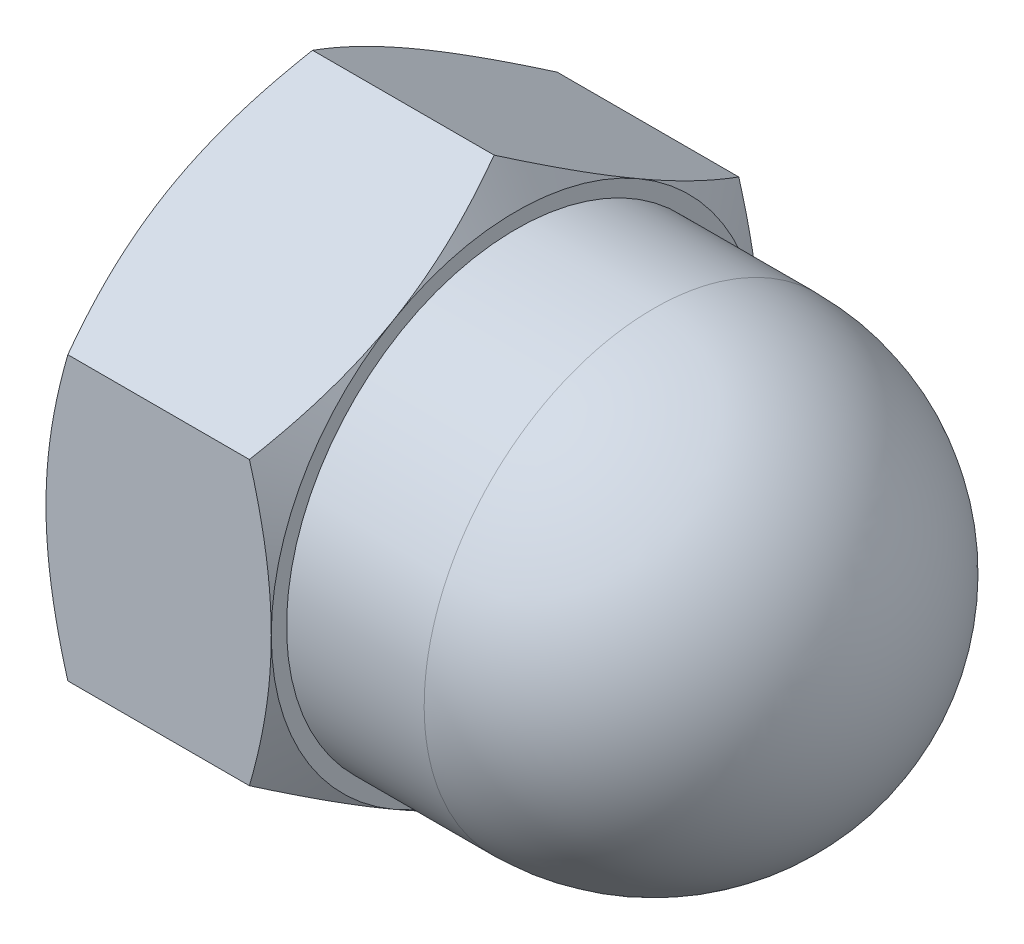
ISO-10303-21;
HEADER;
FILE_DESCRIPTION(('STEP AP214'),'2;1');
FILE_NAME('part.step','',(''),(''),'','','');
FILE_SCHEMA(('AUTOMOTIVE_DESIGN { 1 0 10303 214 1 1 1 1 }'));
ENDSEC;
DATA;
#1=APPLICATION_CONTEXT('core data for automotive mechanical design processes');
#2=APPLICATION_PROTOCOL_DEFINITION('international standard','automotive_design',2000,#1);
#3=PRODUCT_CONTEXT('',#1,'mechanical');
#4=PRODUCT('Part','Part','',(#3));
#5=PRODUCT_RELATED_PRODUCT_CATEGORY('part','',(#4));
#6=PRODUCT_DEFINITION_FORMATION('','',#4);
#7=PRODUCT_DEFINITION_CONTEXT('part definition',#1,'design');
#8=PRODUCT_DEFINITION('design','',#6,#7);
#9=PRODUCT_DEFINITION_SHAPE('','',#8);
#10=(LENGTH_UNIT() NAMED_UNIT(*) SI_UNIT(.MILLI.,.METRE.));
#11=(NAMED_UNIT(*) PLANE_ANGLE_UNIT() SI_UNIT($,.RADIAN.));
#12=(NAMED_UNIT(*) SI_UNIT($,.STERADIAN.) SOLID_ANGLE_UNIT());
#13=UNCERTAINTY_MEASURE_WITH_UNIT(LENGTH_MEASURE(1.E-05),#10,'distance_accuracy_value','');
#14=(GEOMETRIC_REPRESENTATION_CONTEXT(3) GLOBAL_UNCERTAINTY_ASSIGNED_CONTEXT((#13)) GLOBAL_UNIT_ASSIGNED_CONTEXT((#10,
#11,#12)) REPRESENTATION_CONTEXT('',''));
#15=CARTESIAN_POINT('',(0.,0.,0.));
#16=DIRECTION('',(0.,0.,1.));
#17=DIRECTION('',(1.,0.,0.));
#18=AXIS2_PLACEMENT_3D('',#15,#16,#17);
#19=CARTESIAN_POINT('',(6.25,0.,0.));
#20=DIRECTION('',(0.802488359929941,0.499442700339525,0.326449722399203));
#21=DIRECTION('',(-0.37092176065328,0.846136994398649,-0.382712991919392));
#22=AXIS2_PLACEMENT_3D('',#19,#20,#21);
#23=SPHERICAL_SURFACE('',#22,3.75);
#24=CARTESIAN_POINT('',(9.25933134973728,1.87291012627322,1.22418645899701));
#25=VERTEX_POINT('',#24);
#26=VERTEX_LOOP('',#25);
#27=FACE_BOUND('',#26,.T.);
#28=CARTESIAN_POINT('',(6.25,0.,0.));
#29=DIRECTION('',(1.,0.,0.));
#30=DIRECTION('',(0.,0.,-1.));
#31=AXIS2_PLACEMENT_3D('',#28,#29,#30);
#32=CIRCLE('',#31,3.75);
#33=CARTESIAN_POINT('',(6.25,0.,-3.75));
#34=VERTEX_POINT('',#33);
#35=EDGE_CURVE('E20',#34,#34,#32,.F.);
#36=ORIENTED_EDGE('',*,*,#35,.F.);
#37=EDGE_LOOP('',(#36));
#38=FACE_BOUND('',#37,.T.);
#39=ADVANCED_FACE('F16',(#27,#38),#23,.T.);
#40=CARTESIAN_POINT('',(5.125,0.,0.));
#41=DIRECTION('',(1.,0.,0.));
#42=DIRECTION('',(0.,0.,-1.));
#43=AXIS2_PLACEMENT_3D('',#40,#41,#42);
#44=CYLINDRICAL_SURFACE('',#43,3.75);
#45=CARTESIAN_POINT('',(4.,0.,0.));
#46=DIRECTION('',(1.,0.,0.));
#47=DIRECTION('',(0.,0.,-1.));
#48=AXIS2_PLACEMENT_3D('',#45,#46,#47);
#49=CIRCLE('',#48,3.75);
#50=CARTESIAN_POINT('',(4.,0.,-3.75));
#51=VERTEX_POINT('',#50);
#52=EDGE_CURVE('E99',#51,#51,#49,.F.);
#53=ORIENTED_EDGE('',*,*,#52,.F.);
#54=EDGE_LOOP('',(#53));
#55=FACE_BOUND('',#54,.T.);
#56=ORIENTED_EDGE('',*,*,#35,.T.);
#57=EDGE_LOOP('',(#56));
#58=FACE_BOUND('',#57,.T.);
#59=ADVANCED_FACE('F94',(#55,#58),#44,.T.);
#60=CARTESIAN_POINT('',(4.,0.,0.));
#61=DIRECTION('',(1.,0.,0.));
#62=DIRECTION('',(0.,0.,-1.));
#63=AXIS2_PLACEMENT_3D('',#60,#61,#62);
#64=PLANE('',#63);
#65=ORIENTED_EDGE('',*,*,#52,.T.);
#66=EDGE_LOOP('',(#65));
#67=FACE_BOUND('',#66,.T.);
#68=CARTESIAN_POINT('',(3.99999999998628,0.,0.));
#69=DIRECTION('',(-1.,0.,0.));
#70=DIRECTION('',(0.,0.,1.));
#71=AXIS2_PLACEMENT_3D('',#68,#69,#70);
#72=CIRCLE('',#71,3.99999999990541);
#73=CARTESIAN_POINT('',(3.99999999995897,-3.4641016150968,1.99999999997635));
#74=VERTEX_POINT('',#73);
#75=CARTESIAN_POINT('',(3.99999999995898,-3.4641016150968,-1.99999999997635));
#76=VERTEX_POINT('',#75);
#77=EDGE_CURVE('E108',#74,#76,#72,.F.);
#78=ORIENTED_EDGE('',*,*,#77,.T.);
#79=CARTESIAN_POINT('',(3.99999999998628,0.,0.));
#80=DIRECTION('',(-1.,0.,0.));
#81=DIRECTION('',(0.,0.,1.));
#82=AXIS2_PLACEMENT_3D('',#79,#80,#81);
#83=CIRCLE('',#82,3.99999999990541);
#84=CARTESIAN_POINT('',(3.99999999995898,0.,-3.9999999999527));
#85=VERTEX_POINT('',#84);
#86=EDGE_CURVE('E111',#76,#85,#83,.F.);
#87=ORIENTED_EDGE('',*,*,#86,.T.);
#88=CARTESIAN_POINT('',(3.99999999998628,0.,0.));
#89=DIRECTION('',(-1.,0.,0.));
#90=DIRECTION('',(0.,0.,1.));
#91=AXIS2_PLACEMENT_3D('',#88,#89,#90);
#92=CIRCLE('',#91,3.99999999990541);
#93=CARTESIAN_POINT('',(3.99999999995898,3.4641016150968,-1.99999999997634));
#94=VERTEX_POINT('',#93);
#95=EDGE_CURVE('E117',#85,#94,#92,.F.);
#96=ORIENTED_EDGE('',*,*,#95,.T.);
#97=CARTESIAN_POINT('',(3.99999999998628,0.,0.));
#98=DIRECTION('',(-1.,0.,0.));
#99=DIRECTION('',(0.,0.,1.));
#100=AXIS2_PLACEMENT_3D('',#97,#98,#99);
#101=CIRCLE('',#100,3.99999999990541);
#102=CARTESIAN_POINT('',(3.99999999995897,3.46410161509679,1.99999999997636));
#103=VERTEX_POINT('',#102);
#104=EDGE_CURVE('E114',#94,#103,#101,.F.);
#105=ORIENTED_EDGE('',*,*,#104,.T.);
#106=CARTESIAN_POINT('',(3.99999999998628,0.,0.));
#107=DIRECTION('',(-1.,0.,0.));
#108=DIRECTION('',(0.,0.,1.));
#109=AXIS2_PLACEMENT_3D('',#106,#107,#108);
#110=CIRCLE('',#109,3.99999999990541);
#111=CARTESIAN_POINT('',(3.99999999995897,0.,3.99999999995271));
#112=VERTEX_POINT('',#111);
#113=EDGE_CURVE('E87',#103,#112,#110,.F.);
#114=ORIENTED_EDGE('',*,*,#113,.T.);
#115=CARTESIAN_POINT('',(3.99999999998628,0.,0.));
#116=DIRECTION('',(-1.,0.,0.));
#117=DIRECTION('',(0.,0.,1.));
#118=AXIS2_PLACEMENT_3D('',#115,#116,#117);
#119=CIRCLE('',#118,3.99999999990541);
#120=EDGE_CURVE('E103',#112,#74,#119,.F.);
#121=ORIENTED_EDGE('',*,*,#120,.T.);
#122=EDGE_LOOP('',(#78,#87,#96,#105,#114,#121));
#123=FACE_BOUND('',#122,.T.);
#124=ADVANCED_FACE('F236',(#67,#123),#64,.T.);
#125=CARTESIAN_POINT('',(4.0000000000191,0.,0.));
#126=DIRECTION('',(-1.,0.,0.));
#127=DIRECTION('',(0.,0.,1.));
#128=AXIS2_PLACEMENT_3D('',#125,#126,#127);
#129=CONICAL_SURFACE('',#128,3.99999999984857,1.04719755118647);
#130=ORIENTED_EDGE('',*,*,#113,.F.);
#131=CARTESIAN_POINT('',(3.64273441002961,2.30940107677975,3.99999999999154));
#132=CARTESIAN_POINT('',(3.69701440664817,2.40339320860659,3.8372008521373));
#133=CARTESIAN_POINT('',(3.74674436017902,2.49813806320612,3.67309795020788));
#134=CARTESIAN_POINT('',(3.83444223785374,2.68846293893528,3.34344559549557));
#135=CARTESIAN_POINT('',(3.87246832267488,2.7840363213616,3.17790764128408));
#136=CARTESIAN_POINT('',(3.91915789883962,2.92829837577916,2.92803843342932));
#137=CARTESIAN_POINT('',(3.93300183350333,2.97656796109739,2.84443305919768));
#138=CARTESIAN_POINT('',(3.95696597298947,3.07333821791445,2.67682205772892));
#139=CARTESIAN_POINT('',(3.96708627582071,3.12183888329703,2.59281644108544));
#140=CARTESIAN_POINT('',(3.98342533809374,3.21925069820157,2.42409422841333));
#141=CARTESIAN_POINT('',(3.98962425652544,3.2681626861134,2.33937618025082));
#142=CARTESIAN_POINT('',(3.99792016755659,3.36608285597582,2.16977347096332));
#143=CARTESIAN_POINT('',(4.00001634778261,3.41509105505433,2.08488878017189));
#144=CARTESIAN_POINT('',(3.99999999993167,3.46410161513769,2.00000000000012));
#145=B_SPLINE_CURVE_WITH_KNOTS('',3,(#131,#132,#133,#134,#135,#136,#137,#138,#139,#140,#141,
#142,#143,#144),.UNSPECIFIED.,.F.,.F.,(4,2,2,2,2,2,4),(0.,0.587229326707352,1.1714915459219,
1.4640059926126,1.75651273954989,2.05048788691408,2.34452123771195),.UNSPECIFIED.);
#146=CARTESIAN_POINT('',(3.64273441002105,2.30940107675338,3.99999999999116));
#147=VERTEX_POINT('',#146);
#148=EDGE_CURVE('E120',#147,#103,#145,.T.);
#149=ORIENTED_EDGE('',*,*,#148,.F.);
#150=CARTESIAN_POINT('',(3.99999999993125,0.,3.99999999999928));
#151=CARTESIAN_POINT('',(4.00001634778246,0.0980211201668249,3.99999999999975));
#152=CARTESIAN_POINT('',(3.99792016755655,0.196037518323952,3.99999999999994));
#153=CARTESIAN_POINT('',(3.98962425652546,0.391877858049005,4.00000000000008));
#154=CARTESIAN_POINT('',(3.98342533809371,0.489701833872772,4.00000000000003));
#155=CARTESIAN_POINT('',(3.96708627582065,0.684525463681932,3.99999999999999));
#156=CARTESIAN_POINT('',(3.95696597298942,0.78152679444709,4.));
#157=CARTESIAN_POINT('',(3.93300183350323,0.975067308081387,4.00000000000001));
#158=CARTESIAN_POINT('',(3.91915789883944,1.07160647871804,4.00000000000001));
#159=CARTESIAN_POINT('',(3.87246832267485,1.36013058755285,4.00000000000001));
#160=CARTESIAN_POINT('',(3.83444223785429,1.55127735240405,4.00000000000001));
#161=CARTESIAN_POINT('',(3.74674436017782,1.93192710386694,4.00000000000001));
#162=CARTESIAN_POINT('',(3.69701440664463,2.12141681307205,4.00000000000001));
#163=CARTESIAN_POINT('',(3.64273441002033,2.30940107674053,4.00000000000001));
#164=B_SPLINE_CURVE_WITH_KNOTS('',3,(#150,#151,#152,#153,#154,#155,#156,#157,#158,#159,#160,
#161,#162,#163),.UNSPECIFIED.,.F.,.F.,(4,2,2,2,2,2,4),(0.,0.294033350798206,0.588008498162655,
0.880515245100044,1.17302969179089,1.7572919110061,2.34452123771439),.UNSPECIFIED.);
#165=EDGE_CURVE('E232',#112,#147,#164,.T.);
#166=ORIENTED_EDGE('',*,*,#165,.F.);
#167=EDGE_LOOP('',(#130,#149,#166));
#168=FACE_BOUND('',#167,.T.);
#169=ADVANCED_FACE('F133',(#168),#129,.T.);
#170=CARTESIAN_POINT('',(4.0000000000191,0.,0.));
#171=DIRECTION('',(-1.,0.,0.));
#172=DIRECTION('',(0.,0.,1.));
#173=AXIS2_PLACEMENT_3D('',#170,#171,#172);
#174=CONICAL_SURFACE('',#173,3.99999999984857,1.04719755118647);
#175=CARTESIAN_POINT('',(3.99999999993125,-3.46410161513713,1.99999999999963));
#176=CARTESIAN_POINT('',(4.00001634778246,-3.41509105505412,2.08488878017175));
#177=CARTESIAN_POINT('',(3.99792016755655,-3.36608285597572,2.16977347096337));
#178=CARTESIAN_POINT('',(3.98962425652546,-3.26816268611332,2.33937618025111));
#179=CARTESIAN_POINT('',(3.98342533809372,-3.21925069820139,2.42409422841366));
#180=CARTESIAN_POINT('',(3.96708627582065,-3.12183888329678,2.59281644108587));
#181=CARTESIAN_POINT('',(3.95696597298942,-3.07333821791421,2.6768220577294));
#182=CARTESIAN_POINT('',(3.93300183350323,-2.97656796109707,2.8444330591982));
#183=CARTESIAN_POINT('',(3.91915789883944,-2.92829837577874,2.92803843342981));
#184=CARTESIAN_POINT('',(3.87246832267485,-2.78403632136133,3.17790764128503));
#185=CARTESIAN_POINT('',(3.83444223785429,-2.68846293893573,3.34344559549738));
#186=CARTESIAN_POINT('',(3.74674436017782,-2.49813806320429,3.67309795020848));
#187=CARTESIAN_POINT('',(3.69701440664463,-2.40339320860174,3.83720085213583));
#188=CARTESIAN_POINT('',(3.64273441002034,-2.30940107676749,3.99999999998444));
#189=B_SPLINE_CURVE_WITH_KNOTS('',3,(#175,#176,#177,#178,#179,#180,#181,#182,#183,#184,#185,
#186,#187,#188),.UNSPECIFIED.,.F.,.F.,(4,2,2,2,2,2,4),(0.,0.294033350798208,0.588008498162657,
0.880515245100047,1.17302969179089,1.7572919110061,2.3445212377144),.UNSPECIFIED.);
#190=CARTESIAN_POINT('',(3.64273441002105,-2.3094010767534,3.99999999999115));
#191=VERTEX_POINT('',#190);
#192=EDGE_CURVE('E228',#74,#191,#189,.T.);
#193=ORIENTED_EDGE('',*,*,#192,.F.);
#194=ORIENTED_EDGE('',*,*,#120,.F.);
#195=CARTESIAN_POINT('',(3.64273441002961,-2.30940107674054,4.00000000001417));
#196=CARTESIAN_POINT('',(3.69701440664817,-2.12141681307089,4.00000000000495));
#197=CARTESIAN_POINT('',(3.74674436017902,-1.9319271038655,4.0000000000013));
#198=CARTESIAN_POINT('',(3.83444223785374,-1.55127735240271,3.99999999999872));
#199=CARTESIAN_POINT('',(3.87246832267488,-1.36013058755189,3.99999999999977));
#200=CARTESIAN_POINT('',(3.91915789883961,-1.07160647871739,4.00000000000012));
#201=CARTESIAN_POINT('',(3.93300183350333,-0.975067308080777,4.00000000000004));
#202=CARTESIAN_POINT('',(3.95696597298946,-0.78152679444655,3.99999999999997));
#203=CARTESIAN_POINT('',(3.9670862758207,-0.684525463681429,4.));
#204=CARTESIAN_POINT('',(3.98342533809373,-0.489701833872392,4.00000000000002));
#205=CARTESIAN_POINT('',(3.98962425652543,-0.39187785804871,4.00000000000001));
#206=CARTESIAN_POINT('',(3.99792016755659,-0.196037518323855,4.));
#207=CARTESIAN_POINT('',(4.00001634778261,-0.0980211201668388,4.));
#208=CARTESIAN_POINT('',(3.99999999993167,-1.26504367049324E-13,4.00000000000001));
#209=B_SPLINE_CURVE_WITH_KNOTS('',3,(#195,#196,#197,#198,#199,#200,#201,#202,#203,#204,#205,
#206,#207,#208),.UNSPECIFIED.,.F.,.F.,(4,2,2,2,2,2,4),(0.,0.587229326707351,1.1714915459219,
1.4640059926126,1.75651273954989,2.05048788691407,2.34452123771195),.UNSPECIFIED.);
#210=EDGE_CURVE('E231',#191,#112,#209,.T.);
#211=ORIENTED_EDGE('',*,*,#210,.F.);
#212=EDGE_LOOP('',(#193,#194,#211));
#213=FACE_BOUND('',#212,.T.);
#214=ADVANCED_FACE('F242',(#213),#174,.T.);
#215=CARTESIAN_POINT('',(4.0000000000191,0.,0.));
#216=DIRECTION('',(-1.,0.,0.));
#217=DIRECTION('',(0.,0.,1.));
#218=AXIS2_PLACEMENT_3D('',#215,#216,#217);
#219=CONICAL_SURFACE('',#218,3.99999999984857,1.04719755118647);
#220=CARTESIAN_POINT('',(3.99999999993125,-3.46410161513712,-1.99999999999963));
#221=CARTESIAN_POINT('',(4.00001634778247,-3.51311217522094,-1.91511121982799));
#222=CARTESIAN_POINT('',(3.99792016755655,-3.56212037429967,-1.83022652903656));
#223=CARTESIAN_POINT('',(3.98962425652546,-3.66004054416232,-1.66062381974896));
#224=CARTESIAN_POINT('',(3.98342533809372,-3.70895253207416,-1.57590577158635));
#225=CARTESIAN_POINT('',(3.96708627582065,-3.80636434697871,-1.40718355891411));
#226=CARTESIAN_POINT('',(3.95696597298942,-3.8548650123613,-1.32317794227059));
#227=CARTESIAN_POINT('',(3.93300183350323,-3.95163526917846,-1.1555669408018));
#228=CARTESIAN_POINT('',(3.91915789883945,-3.99990485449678,-1.07196156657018));
#229=CARTESIAN_POINT('',(3.87246832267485,-4.14416690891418,-0.822092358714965));
#230=CARTESIAN_POINT('',(3.83444223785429,-4.23974029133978,-0.656554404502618));
#231=CARTESIAN_POINT('',(3.74674436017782,-4.43006516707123,-0.326902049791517));
#232=CARTESIAN_POINT('',(3.69701440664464,-4.52481002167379,-0.162799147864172));
#233=CARTESIAN_POINT('',(3.64273441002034,-4.61880215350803,-1.55516088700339E-11));
#234=B_SPLINE_CURVE_WITH_KNOTS('',3,(#220,#221,#222,#223,#224,#225,#226,#227,#228,#229,#230,
#231,#232,#233),.UNSPECIFIED.,.F.,.F.,(4,2,2,2,2,2,4),(0.,0.294033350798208,0.588008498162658,
0.880515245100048,1.17302969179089,1.75729191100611,2.3445212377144),.UNSPECIFIED.);
#235=CARTESIAN_POINT('',(3.64273441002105,-4.61880215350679,0.));
#236=VERTEX_POINT('',#235);
#237=EDGE_CURVE('E224',#76,#236,#234,.T.);
#238=ORIENTED_EDGE('',*,*,#237,.F.);
#239=ORIENTED_EDGE('',*,*,#77,.F.);
#240=CARTESIAN_POINT('',(3.64273441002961,-4.6188021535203,2.26445524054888E-11));
#241=CARTESIAN_POINT('',(3.69701440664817,-4.52481002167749,0.162799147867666));
#242=CARTESIAN_POINT('',(3.74674436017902,-4.43006516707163,0.326902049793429));
#243=CARTESIAN_POINT('',(3.83444223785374,-4.23974029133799,0.656554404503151));
#244=CARTESIAN_POINT('',(3.87246832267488,-4.14416690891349,0.822092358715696));
#245=CARTESIAN_POINT('',(3.91915789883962,-3.99990485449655,1.07196156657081));
#246=CARTESIAN_POINT('',(3.93300183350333,-3.95163526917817,1.15556694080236));
#247=CARTESIAN_POINT('',(3.95696597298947,-3.854865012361,1.32317794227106));
#248=CARTESIAN_POINT('',(3.96708627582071,-3.80636434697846,1.40718355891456));
#249=CARTESIAN_POINT('',(3.98342533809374,-3.70895253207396,1.57590577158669));
#250=CARTESIAN_POINT('',(3.98962425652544,-3.66004054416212,1.66062381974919));
#251=CARTESIAN_POINT('',(3.99792016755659,-3.56212037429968,1.83022652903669));
#252=CARTESIAN_POINT('',(4.00001634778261,-3.51311217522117,1.91511121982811));
#253=CARTESIAN_POINT('',(3.99999999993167,-3.46410161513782,1.99999999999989));
#254=B_SPLINE_CURVE_WITH_KNOTS('',3,(#240,#241,#242,#243,#244,#245,#246,#247,#248,#249,#250,
#251,#252,#253),.UNSPECIFIED.,.F.,.F.,(4,2,2,2,2,2,4),(0.,0.58722932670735,1.1714915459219,
1.4640059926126,1.75651273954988,2.05048788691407,2.34452123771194),.UNSPECIFIED.);
#255=EDGE_CURVE('E227',#236,#74,#254,.T.);
#256=ORIENTED_EDGE('',*,*,#255,.F.);
#257=EDGE_LOOP('',(#238,#239,#256));
#258=FACE_BOUND('',#257,.T.);
#259=ADVANCED_FACE('F297',(#258),#219,.T.);
#260=CARTESIAN_POINT('',(4.0000000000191,0.,0.));
#261=DIRECTION('',(-1.,0.,0.));
#262=DIRECTION('',(0.,0.,1.));
#263=AXIS2_PLACEMENT_3D('',#260,#261,#262);
#264=CONICAL_SURFACE('',#263,3.99999999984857,1.04719755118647);
#265=CARTESIAN_POINT('',(3.99999999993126,0.,-3.99999999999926));
#266=CARTESIAN_POINT('',(4.00001634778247,-0.0980211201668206,-3.99999999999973));
#267=CARTESIAN_POINT('',(3.99792016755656,-0.196037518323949,-3.99999999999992));
#268=CARTESIAN_POINT('',(3.98962425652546,-0.391877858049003,-4.00000000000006));
#269=CARTESIAN_POINT('',(3.98342533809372,-0.489701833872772,-4.00000000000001));
#270=CARTESIAN_POINT('',(3.96708627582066,-0.684525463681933,-3.99999999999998));
#271=CARTESIAN_POINT('',(3.95696597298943,-0.781526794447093,-3.99999999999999));
#272=CARTESIAN_POINT('',(3.93300183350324,-0.975067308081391,-4.));
#273=CARTESIAN_POINT('',(3.91915789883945,-1.07160647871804,-4.));
#274=CARTESIAN_POINT('',(3.87246832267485,-1.36013058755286,-3.99999999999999));
#275=CARTESIAN_POINT('',(3.83444223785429,-1.55127735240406,-3.99999999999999));
#276=CARTESIAN_POINT('',(3.74674436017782,-1.93192710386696,-4.));
#277=CARTESIAN_POINT('',(3.69701440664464,-2.12141681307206,-4.));
#278=CARTESIAN_POINT('',(3.64273441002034,-2.30940107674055,-4.));
#279=B_SPLINE_CURVE_WITH_KNOTS('',3,(#265,#266,#267,#268,#269,#270,#271,#272,#273,#274,#275,
#276,#277,#278),.UNSPECIFIED.,.F.,.F.,(4,2,2,2,2,2,4),(0.,0.294033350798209,0.588008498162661,
0.880515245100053,1.1730296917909,1.75729191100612,2.34452123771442),.UNSPECIFIED.);
#280=CARTESIAN_POINT('',(3.64273441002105,-2.3094010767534,-3.99999999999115));
#281=VERTEX_POINT('',#280);
#282=EDGE_CURVE('E220',#85,#281,#279,.T.);
#283=ORIENTED_EDGE('',*,*,#282,.F.);
#284=ORIENTED_EDGE('',*,*,#86,.F.);
#285=CARTESIAN_POINT('',(3.64273441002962,-2.30940107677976,-3.99999999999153));
#286=CARTESIAN_POINT('',(3.69701440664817,-2.4033932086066,-3.83720085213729));
#287=CARTESIAN_POINT('',(3.74674436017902,-2.49813806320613,-3.67309795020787));
#288=CARTESIAN_POINT('',(3.83444223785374,-2.68846293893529,-3.34344559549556));
#289=CARTESIAN_POINT('',(3.87246832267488,-2.78403632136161,-3.17790764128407));
#290=CARTESIAN_POINT('',(3.91915789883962,-2.92829837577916,-2.9280384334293));
#291=CARTESIAN_POINT('',(3.93300183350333,-2.9765679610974,-2.84443305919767));
#292=CARTESIAN_POINT('',(3.95696597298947,-3.07333821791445,-2.67682205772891));
#293=CARTESIAN_POINT('',(3.96708627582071,-3.12183888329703,-2.59281644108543));
#294=CARTESIAN_POINT('',(3.98342533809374,-3.21925069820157,-2.42409422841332));
#295=CARTESIAN_POINT('',(3.98962425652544,-3.26816268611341,-2.33937618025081));
#296=CARTESIAN_POINT('',(3.99792016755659,-3.36608285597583,-2.16977347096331));
#297=CARTESIAN_POINT('',(4.00001634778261,-3.41509105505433,-2.08488878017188));
#298=CARTESIAN_POINT('',(3.99999999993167,-3.46410161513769,-2.0000000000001));
#299=B_SPLINE_CURVE_WITH_KNOTS('',3,(#285,#286,#287,#288,#289,#290,#291,#292,#293,#294,#295,
#296,#297,#298),.UNSPECIFIED.,.F.,.F.,(4,2,2,2,2,2,4),(0.,0.587229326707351,1.1714915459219,
1.4640059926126,1.75651273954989,2.05048788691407,2.34452123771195),.UNSPECIFIED.);
#300=EDGE_CURVE('E223',#281,#76,#299,.T.);
#301=ORIENTED_EDGE('',*,*,#300,.F.);
#302=EDGE_LOOP('',(#283,#284,#301));
#303=FACE_BOUND('',#302,.T.);
#304=ADVANCED_FACE('F293',(#303),#264,.T.);
#305=CARTESIAN_POINT('',(4.0000000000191,0.,0.));
#306=DIRECTION('',(-1.,0.,0.));
#307=DIRECTION('',(0.,0.,1.));
#308=AXIS2_PLACEMENT_3D('',#305,#306,#307);
#309=CONICAL_SURFACE('',#308,3.99999999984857,1.04719755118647);
#310=ORIENTED_EDGE('',*,*,#104,.F.);
#311=CARTESIAN_POINT('',(3.64273441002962,4.6188021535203,-2.26263899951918E-11));
#312=CARTESIAN_POINT('',(3.69701440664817,4.52481002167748,-0.162799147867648));
#313=CARTESIAN_POINT('',(3.74674436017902,4.43006516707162,-0.326902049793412));
#314=CARTESIAN_POINT('',(3.83444223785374,4.23974029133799,-0.656554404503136));
#315=CARTESIAN_POINT('',(3.87246832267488,4.14416690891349,-0.822092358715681));
#316=CARTESIAN_POINT('',(3.91915789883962,3.99990485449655,-1.0719615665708));
#317=CARTESIAN_POINT('',(3.93300183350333,3.95163526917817,-1.15556694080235));
#318=CARTESIAN_POINT('',(3.95696597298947,3.854865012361,-1.32317794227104));
#319=CARTESIAN_POINT('',(3.96708627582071,3.80636434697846,-1.40718355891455));
#320=CARTESIAN_POINT('',(3.98342533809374,3.70895253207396,-1.57590577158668));
#321=CARTESIAN_POINT('',(3.98962425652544,3.66004054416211,-1.66062381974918));
#322=CARTESIAN_POINT('',(3.99792016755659,3.56212037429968,-1.83022652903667));
#323=CARTESIAN_POINT('',(4.00001634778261,3.51311217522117,-1.9151112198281));
#324=CARTESIAN_POINT('',(3.99999999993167,3.46410161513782,-1.99999999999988));
#325=B_SPLINE_CURVE_WITH_KNOTS('',3,(#311,#312,#313,#314,#315,#316,#317,#318,#319,#320,#321,
#322,#323,#324),.UNSPECIFIED.,.F.,.F.,(4,2,2,2,2,2,4),(0.,0.587229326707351,1.1714915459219,
1.4640059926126,1.75651273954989,2.05048788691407,2.34452123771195),.UNSPECIFIED.);
#326=CARTESIAN_POINT('',(3.6427344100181,4.61880215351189,8.85943256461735E-12));
#327=VERTEX_POINT('',#326);
#328=EDGE_CURVE('E219',#327,#94,#325,.T.);
#329=ORIENTED_EDGE('',*,*,#328,.F.);
#330=CARTESIAN_POINT('',(3.99999999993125,3.46410161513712,1.99999999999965));
#331=CARTESIAN_POINT('',(4.00001634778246,3.51311217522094,1.915111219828));
#332=CARTESIAN_POINT('',(3.99792016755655,3.56212037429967,1.83022652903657));
#333=CARTESIAN_POINT('',(3.98962425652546,3.66004054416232,1.66062381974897));
#334=CARTESIAN_POINT('',(3.98342533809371,3.70895253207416,1.57590577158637));
#335=CARTESIAN_POINT('',(3.96708627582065,3.80636434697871,1.40718355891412));
#336=CARTESIAN_POINT('',(3.95696597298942,3.8548650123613,1.3231779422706));
#337=CARTESIAN_POINT('',(3.93300183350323,3.95163526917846,1.15556694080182));
#338=CARTESIAN_POINT('',(3.91915789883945,3.99990485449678,1.0719615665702));
#339=CARTESIAN_POINT('',(3.87246832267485,4.14416690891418,0.822092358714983));
#340=CARTESIAN_POINT('',(3.83444223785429,4.23974029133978,0.656554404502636));
#341=CARTESIAN_POINT('',(3.74674436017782,4.43006516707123,0.326902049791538));
#342=CARTESIAN_POINT('',(3.69701440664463,4.52481002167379,0.162799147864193));
#343=CARTESIAN_POINT('',(3.64273441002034,4.61880215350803,1.55726622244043E-11));
#344=B_SPLINE_CURVE_WITH_KNOTS('',3,(#330,#331,#332,#333,#334,#335,#336,#337,#338,#339,#340,
#341,#342,#343),.UNSPECIFIED.,.F.,.F.,(4,2,2,2,2,2,4),(0.,0.294033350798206,0.588008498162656,
0.880515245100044,1.17302969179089,1.7572919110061,2.3445212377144),.UNSPECIFIED.);
#345=EDGE_CURVE('E127',#103,#327,#344,.T.);
#346=ORIENTED_EDGE('',*,*,#345,.F.);
#347=EDGE_LOOP('',(#310,#329,#346));
#348=FACE_BOUND('',#347,.T.);
#349=ADVANCED_FACE('F289',(#348),#309,.T.);
#350=CARTESIAN_POINT('',(4.0000000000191,0.,0.));
#351=DIRECTION('',(-1.,0.,0.));
#352=DIRECTION('',(0.,0.,1.));
#353=AXIS2_PLACEMENT_3D('',#350,#351,#352);
#354=CONICAL_SURFACE('',#353,3.99999999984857,1.04719755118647);
#355=ORIENTED_EDGE('',*,*,#95,.F.);
#356=CARTESIAN_POINT('',(3.64273441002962,2.30940107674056,-4.00000000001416));
#357=CARTESIAN_POINT('',(3.69701440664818,2.1214168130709,-4.00000000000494));
#358=CARTESIAN_POINT('',(3.74674436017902,1.93192710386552,-4.00000000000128));
#359=CARTESIAN_POINT('',(3.83444223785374,1.55127735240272,-3.9999999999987));
#360=CARTESIAN_POINT('',(3.87246832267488,1.3601305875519,-3.99999999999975));
#361=CARTESIAN_POINT('',(3.91915789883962,1.0716064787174,-4.00000000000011));
#362=CARTESIAN_POINT('',(3.93300183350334,0.975067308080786,-4.00000000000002));
#363=CARTESIAN_POINT('',(3.95696597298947,0.781526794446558,-3.99999999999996));
#364=CARTESIAN_POINT('',(3.96708627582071,0.684525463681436,-3.99999999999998));
#365=CARTESIAN_POINT('',(3.98342533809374,0.489701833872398,-4.));
#366=CARTESIAN_POINT('',(3.98962425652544,0.391877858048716,-4.));
#367=CARTESIAN_POINT('',(3.9979201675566,0.19603751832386,-3.99999999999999));
#368=CARTESIAN_POINT('',(4.00001634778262,0.0980211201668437,-3.99999999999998));
#369=CARTESIAN_POINT('',(3.99999999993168,1.31118724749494E-13,-3.99999999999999));
#370=B_SPLINE_CURVE_WITH_KNOTS('',3,(#356,#357,#358,#359,#360,#361,#362,#363,#364,#365,#366,
#367,#368,#369),.UNSPECIFIED.,.F.,.F.,(4,2,2,2,2,2,4),(0.,0.587229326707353,1.1714915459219,
1.46400599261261,1.75651273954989,2.05048788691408,2.34452123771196),.UNSPECIFIED.);
#371=CARTESIAN_POINT('',(3.64273441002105,2.30940107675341,-3.99999999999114));
#372=VERTEX_POINT('',#371);
#373=EDGE_CURVE('E364',#372,#85,#370,.T.);
#374=ORIENTED_EDGE('',*,*,#373,.F.);
#375=CARTESIAN_POINT('',(3.99999999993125,3.46410161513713,-1.99999999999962));
#376=CARTESIAN_POINT('',(4.00001634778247,3.41509105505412,-2.08488878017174));
#377=CARTESIAN_POINT('',(3.99792016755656,3.36608285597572,-2.16977347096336));
#378=CARTESIAN_POINT('',(3.98962425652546,3.26816268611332,-2.3393761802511));
#379=CARTESIAN_POINT('',(3.98342533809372,3.21925069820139,-2.42409422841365));
#380=CARTESIAN_POINT('',(3.96708627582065,3.12183888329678,-2.59281644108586));
#381=CARTESIAN_POINT('',(3.95696597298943,3.07333821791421,-2.67682205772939));
#382=CARTESIAN_POINT('',(3.93300183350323,2.97656796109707,-2.84443305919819));
#383=CARTESIAN_POINT('',(3.91915789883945,2.92829837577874,-2.9280384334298));
#384=CARTESIAN_POINT('',(3.87246832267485,2.78403632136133,-3.17790764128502));
#385=CARTESIAN_POINT('',(3.83444223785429,2.68846293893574,-3.34344559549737));
#386=CARTESIAN_POINT('',(3.74674436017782,2.49813806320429,-3.67309795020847));
#387=CARTESIAN_POINT('',(3.69701440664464,2.40339320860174,-3.83720085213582));
#388=CARTESIAN_POINT('',(3.64273441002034,2.3094010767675,-3.99999999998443));
#389=B_SPLINE_CURVE_WITH_KNOTS('',3,(#375,#376,#377,#378,#379,#380,#381,#382,#383,#384,#385,
#386,#387,#388),.UNSPECIFIED.,.F.,.F.,(4,2,2,2,2,2,4),(0.,0.294033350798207,0.588008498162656,
0.880515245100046,1.17302969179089,1.7572919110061,2.3445212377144),.UNSPECIFIED.);
#390=EDGE_CURVE('E165',#94,#372,#389,.T.);
#391=ORIENTED_EDGE('',*,*,#390,.F.);
#392=EDGE_LOOP('',(#355,#374,#391));
#393=FACE_BOUND('',#392,.T.);
#394=ADVANCED_FACE('F143',(#393),#354,.T.);
#395=CARTESIAN_POINT('',(0.,2.30940107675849,4.00000000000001));
#396=DIRECTION('',(0.,0.866025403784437,0.500000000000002));
#397=DIRECTION('',(0.,-0.500000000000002,0.866025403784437));
#398=AXIS2_PLACEMENT_3D('',#395,#396,#397);
#399=PLANE('',#398);
#400=CARTESIAN_POINT('',(0.674808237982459,4.61880215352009,4.43469064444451E-12));
#401=CARTESIAN_POINT('',(0.61619932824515,4.51731796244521,0.175775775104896));
#402=CARTESIAN_POINT('',(0.56289759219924,4.41495776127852,0.35306884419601));
#403=CARTESIAN_POINT('',(0.469861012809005,4.20846506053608,0.710724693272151));
#404=CARTESIAN_POINT('',(0.430159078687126,4.10432889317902,0.891093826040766));
#405=CARTESIAN_POINT('',(0.368360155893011,3.89734706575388,1.24959686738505));
#406=CARTESIAN_POINT('',(0.345851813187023,3.79453324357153,1.42767563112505));
#407=CARTESIAN_POINT('',(0.318986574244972,3.58842207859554,1.78467064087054));
#408=CARTESIAN_POINT('',(0.314607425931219,3.4851254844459,1.9635855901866));
#409=CARTESIAN_POINT('',(0.323740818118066,3.2921268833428,2.29786897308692));
#410=CARTESIAN_POINT('',(0.335010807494,3.20239591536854,2.45328756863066));
#411=CARTESIAN_POINT('',(0.370722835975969,3.02351854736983,2.76311225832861));
#412=CARTESIAN_POINT('',(0.395177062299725,2.93437276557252,2.917517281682));
#413=CARTESIAN_POINT('',(0.456307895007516,2.75512689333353,3.22798023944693));
#414=CARTESIAN_POINT('',(0.493243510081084,2.66504947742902,3.38399890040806));
#415=CARTESIAN_POINT('',(0.577071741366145,2.48623776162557,3.69370987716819));
#416=CARTESIAN_POINT('',(0.623944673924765,2.39750117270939,3.84740615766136));
#417=CARTESIAN_POINT('',(0.67480821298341,2.3094011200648,3.99999992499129));
#418=B_SPLINE_CURVE_WITH_KNOTS('',3,(#400,#401,#402,#403,#404,#405,#406,#407,#408,#409,#410,
#411,#412,#413,#414,#415,#416,#417),.UNSPECIFIED.,.F.,.F.,(4,2,2,2,2,2,2,2,4),(0.,
0.63403202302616,1.269587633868,1.8894152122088,2.50848177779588,3.04741554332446,
3.58684834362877,4.13824317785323,4.68855585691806),.UNSPECIFIED.);
#419=CARTESIAN_POINT('',(0.674808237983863,4.61880215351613,0.));
#420=VERTEX_POINT('',#419);
#421=CARTESIAN_POINT('',(0.674808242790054,2.30940109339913,4.00000000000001));
#422=VERTEX_POINT('',#421);
#423=EDGE_CURVE('E151',#420,#422,#418,.T.);
#424=ORIENTED_EDGE('',*,*,#423,.T.);
#425=DIRECTION('',(1.,0.,0.));
#426=VECTOR('',#425,1.);
#427=CARTESIAN_POINT('',(0.,2.30940107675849,4.00000000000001));
#428=LINE('',#427,#426);
#429=EDGE_CURVE('E229',#147,#422,#428,.F.);
#430=ORIENTED_EDGE('',*,*,#429,.F.);
#431=ORIENTED_EDGE('',*,*,#148,.T.);
#432=ORIENTED_EDGE('',*,*,#345,.T.);
#433=DIRECTION('',(1.,0.,0.));
#434=VECTOR('',#433,1.);
#435=CARTESIAN_POINT('',(0.,4.618802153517,0.));
#436=LINE('',#435,#434);
#437=EDGE_CURVE('E160',#420,#327,#436,.T.);
#438=ORIENTED_EDGE('',*,*,#437,.F.);
#439=EDGE_LOOP('',(#424,#430,#431,#432,#438));
#440=FACE_BOUND('',#439,.T.);
#441=ADVANCED_FACE('F137',(#440),#399,.T.);
#442=CARTESIAN_POINT('',(0.,-2.30940107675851,4.));
#443=DIRECTION('',(0.,0.,1.));
#444=DIRECTION('',(0.,-1.,0.));
#445=AXIS2_PLACEMENT_3D('',#442,#443,#444);
#446=PLANE('',#445);
#447=DIRECTION('',(1.,0.,0.));
#448=VECTOR('',#447,1.);
#449=CARTESIAN_POINT('',(0.,-2.30940107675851,3.99999999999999));
#450=LINE('',#449,#448);
#451=CARTESIAN_POINT('',(0.674808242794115,-2.30940106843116,4.0000000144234));
#452=VERTEX_POINT('',#451);
#453=EDGE_CURVE('E225',#191,#452,#450,.F.);
#454=ORIENTED_EDGE('',*,*,#453,.F.);
#455=ORIENTED_EDGE('',*,*,#210,.T.);
#456=ORIENTED_EDGE('',*,*,#165,.T.);
#457=ORIENTED_EDGE('',*,*,#429,.T.);
#458=CARTESIAN_POINT('',(0.674808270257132,2.30940110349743,3.99999996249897));
#459=CARTESIAN_POINT('',(0.616199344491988,2.10643272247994,3.99999998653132));
#460=CARTESIAN_POINT('',(0.562897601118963,1.90171231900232,3.99999999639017));
#461=CARTESIAN_POINT('',(0.469861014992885,1.48872691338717,4.00000000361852));
#462=CARTESIAN_POINT('',(0.43015908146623,1.28045457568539,4.00000000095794));
#463=CARTESIAN_POINT('',(0.368360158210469,0.866490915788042,3.99999999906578));
#464=CARTESIAN_POINT('',(0.34585181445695,0.660863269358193,3.99999999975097));
#465=CARTESIAN_POINT('',(0.318986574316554,0.248640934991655,4.00000000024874));
#466=CARTESIAN_POINT('',(0.314607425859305,0.0420477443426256,4.00000000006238));
#467=CARTESIAN_POINT('',(0.323740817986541,-0.343949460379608,3.99999999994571));
#468=CARTESIAN_POINT('',(0.335010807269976,-0.52341139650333,3.99999999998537));
#469=CARTESIAN_POINT('',(0.370722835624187,-0.881166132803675,4.00000000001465));
#470=CARTESIAN_POINT('',(0.395177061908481,-1.05945769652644,4.00000000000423));
#471=CARTESIAN_POINT('',(0.456307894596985,-1.41794944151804,3.99999999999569));
#472=CARTESIAN_POINT('',(0.493243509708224,-1.59810427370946,3.99999999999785));
#473=CARTESIAN_POINT('',(0.577071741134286,-1.95572770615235,4.00000000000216));
#474=CARTESIAN_POINT('',(0.62394467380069,-2.13320088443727,4.0000000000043));
#475=CARTESIAN_POINT('',(0.674808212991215,-2.30940099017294,4.));
#476=B_SPLINE_CURVE_WITH_KNOTS('',3,(#458,#459,#460,#461,#462,#463,#464,#465,#466,#467,#468,
#469,#470,#471,#472,#473,#474,#475),.UNSPECIFIED.,.F.,.F.,(4,2,2,2,2,2,2,2,4),(0.,
0.634032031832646,1.26958765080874,1.88941523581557,2.50848180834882,3.04741557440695,
3.58684837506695,4.13824321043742,4.68855589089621),.UNSPECIFIED.);
#477=EDGE_CURVE('E159',#422,#452,#476,.T.);
#478=ORIENTED_EDGE('',*,*,#477,.T.);
#479=EDGE_LOOP('',(#454,#455,#456,#457,#478));
#480=FACE_BOUND('',#479,.T.);
#481=ADVANCED_FACE('F142',(#480),#446,.T.);
#482=CARTESIAN_POINT('',(0.,-4.61880215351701,0.));
#483=DIRECTION('',(0.,-0.866025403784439,0.499999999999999));
#484=DIRECTION('',(0.,-0.499999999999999,-0.866025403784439));
#485=AXIS2_PLACEMENT_3D('',#482,#483,#484);
#486=PLANE('',#485);
#487=DIRECTION('',(1.,0.,0.));
#488=VECTOR('',#487,1.);
#489=CARTESIAN_POINT('',(0.,-4.61880215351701,0.));
#490=LINE('',#489,#488);
#491=CARTESIAN_POINT('',(0.674808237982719,-4.61880215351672,0.));
#492=VERTEX_POINT('',#491);
#493=EDGE_CURVE('E221',#236,#492,#490,.F.);
#494=ORIENTED_EDGE('',*,*,#493,.F.);
#495=ORIENTED_EDGE('',*,*,#255,.T.);
#496=ORIENTED_EDGE('',*,*,#192,.T.);
#497=ORIENTED_EDGE('',*,*,#453,.T.);
#498=CARTESIAN_POINT('',(0.67480827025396,-2.30940103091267,4.00000000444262));
#499=CARTESIAN_POINT('',(0.616199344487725,-2.41088524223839,3.82422424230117));
#500=CARTESIAN_POINT('',(0.562897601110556,-2.51324545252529,3.6469311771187));
#501=CARTESIAN_POINT('',(0.469861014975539,-2.71973816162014,3.28927532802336));
#502=CARTESIAN_POINT('',(0.430159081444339,-2.82387432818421,3.10890619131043));
#503=CARTESIAN_POINT('',(0.36836015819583,-3.03085615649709,2.7504031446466));
#504=CARTESIAN_POINT('',(0.345851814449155,-3.13366998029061,2.57232437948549));
#505=CARTESIAN_POINT('',(0.318986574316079,-3.3397811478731,2.2153293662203));
#506=CARTESIAN_POINT('',(0.314607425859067,-3.44307774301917,2.03641441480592));
#507=CARTESIAN_POINT('',(0.323740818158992,-3.63607634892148,1.70213102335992));
#508=CARTESIAN_POINT('',(0.335010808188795,-3.72580732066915,1.54671242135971));
#509=CARTESIAN_POINT('',(0.370722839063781,-3.90468469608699,1.23688771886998));
#510=CARTESIAN_POINT('',(0.395177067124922,-3.99383048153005,1.08248268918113));
#511=CARTESIAN_POINT('',(0.45630790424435,-4.17307636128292,0.772019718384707));
#512=CARTESIAN_POINT('',(0.493243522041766,-4.2631537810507,0.616001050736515));
#513=CARTESIAN_POINT('',(0.577071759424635,-4.44196550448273,0.306290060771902));
#514=CARTESIAN_POINT('',(0.623944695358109,-4.53070209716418,0.152593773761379));
#515=CARTESIAN_POINT('',(0.674808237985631,-4.61880215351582,2.05105474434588E-12));
#516=B_SPLINE_CURVE_WITH_KNOTS('',3,(#498,#499,#500,#501,#502,#503,#504,#505,#506,#507,#508,
#509,#510,#511,#512,#513,#514,#515),.UNSPECIFIED.,.F.,.F.,(4,2,2,2,2,2,2,2,4),(0.,
0.634032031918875,1.26958765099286,1.88941523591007,2.50848180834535,3.04741559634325,
3.58684841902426,4.13824327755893,4.68855598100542),.UNSPECIFIED.);
#517=EDGE_CURVE('E192',#452,#492,#516,.T.);
#518=ORIENTED_EDGE('',*,*,#517,.T.);
#519=EDGE_LOOP('',(#494,#495,#496,#497,#518));
#520=FACE_BOUND('',#519,.T.);
#521=ADVANCED_FACE('F278',(#520),#486,.T.);
#522=CARTESIAN_POINT('',(0.,-2.3094010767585,-4.));
#523=DIRECTION('',(0.,-0.866025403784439,-0.5));
#524=DIRECTION('',(0.,0.5,-0.866025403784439));
#525=AXIS2_PLACEMENT_3D('',#522,#523,#524);
#526=PLANE('',#525);
#527=DIRECTION('',(1.,0.,0.));
#528=VECTOR('',#527,1.);
#529=CARTESIAN_POINT('',(0.,-2.30940107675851,-4.));
#530=LINE('',#529,#528);
#531=CARTESIAN_POINT('',(0.674808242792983,-2.3094010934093,-4.));
#532=VERTEX_POINT('',#531);
#533=EDGE_CURVE('E217',#281,#532,#530,.F.);
#534=ORIENTED_EDGE('',*,*,#533,.F.);
#535=ORIENTED_EDGE('',*,*,#300,.T.);
#536=ORIENTED_EDGE('',*,*,#237,.T.);
#537=ORIENTED_EDGE('',*,*,#493,.T.);
#538=CARTESIAN_POINT('',(0.674808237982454,-4.61880215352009,-4.42236030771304E-12));
#539=CARTESIAN_POINT('',(0.616199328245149,-4.51731796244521,-0.175775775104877));
#540=CARTESIAN_POINT('',(0.562897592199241,-4.41495776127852,-0.353068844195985));
#541=CARTESIAN_POINT('',(0.469861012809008,-4.20846506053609,-0.710724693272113));
#542=CARTESIAN_POINT('',(0.430159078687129,-4.10432889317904,-0.891093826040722));
#543=CARTESIAN_POINT('',(0.368360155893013,-3.8973470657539,-1.249596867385));
#544=CARTESIAN_POINT('',(0.345851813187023,-3.79453324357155,-1.42767563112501));
#545=CARTESIAN_POINT('',(0.31898657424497,-3.58842207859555,-1.78467064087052));
#546=CARTESIAN_POINT('',(0.314607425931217,-3.4851254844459,-1.96358559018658));
#547=CARTESIAN_POINT('',(0.323740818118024,-3.29212688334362,-2.29786897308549));
#548=CARTESIAN_POINT('',(0.335010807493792,-3.20239591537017,-2.45328756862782));
#549=CARTESIAN_POINT('',(0.370722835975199,-3.02351854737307,-2.76311225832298));
#550=CARTESIAN_POINT('',(0.395177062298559,-2.93437276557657,-2.91751728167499));
#551=CARTESIAN_POINT('',(0.456307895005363,-2.75512689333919,-3.22798023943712));
#552=CARTESIAN_POINT('',(0.493243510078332,-2.6650494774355,-3.38399890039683));
#553=CARTESIAN_POINT('',(0.577071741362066,-2.48623776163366,-3.69370987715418));
#554=CARTESIAN_POINT('',(0.623944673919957,-2.39750117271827,-3.84740615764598));
#555=CARTESIAN_POINT('',(0.674808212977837,-2.30940112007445,-3.99999992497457));
#556=B_SPLINE_CURVE_WITH_KNOTS('',3,(#538,#539,#540,#541,#542,#543,#544,#545,#546,#547,#548,
#549,#550,#551,#552,#553,#554,#555),.UNSPECIFIED.,.F.,.F.,(4,2,2,2,2,2,2,2,4),(0.,
0.634032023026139,1.26958763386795,1.88941521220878,2.50848177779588,3.04741554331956,
3.58684834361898,4.13824317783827,4.68855585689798),.UNSPECIFIED.);
#557=EDGE_CURVE('E335',#492,#532,#556,.T.);
#558=ORIENTED_EDGE('',*,*,#557,.T.);
#559=EDGE_LOOP('',(#534,#535,#536,#537,#558));
#560=FACE_BOUND('',#559,.T.);
#561=ADVANCED_FACE('F274',(#560),#526,.T.);
#562=CARTESIAN_POINT('',(0.,2.30940107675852,-3.99999999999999));
#563=DIRECTION('',(0.,0.,-1.));
#564=DIRECTION('',(0.,1.,0.));
#565=AXIS2_PLACEMENT_3D('',#562,#563,#564);
#566=PLANE('',#565);
#567=CARTESIAN_POINT('',(0.674808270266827,-2.30940110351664,-3.99999996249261));
#568=CARTESIAN_POINT('',(0.616199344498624,-2.1064327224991,-3.99999998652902));
#569=CARTESIAN_POINT('',(0.562897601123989,-1.90171231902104,-3.99999999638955));
#570=CARTESIAN_POINT('',(0.469861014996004,-1.48872691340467,-4.00000000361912));
#571=CARTESIAN_POINT('',(0.430159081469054,-1.28045457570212,-4.00000000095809));
#572=CARTESIAN_POINT('',(0.368360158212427,-0.866490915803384,-3.99999999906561));
#573=CARTESIAN_POINT('',(0.345851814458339,-0.66086326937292,-3.99999999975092));
#574=CARTESIAN_POINT('',(0.318986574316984,-0.248640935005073,-4.00000000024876));
#575=CARTESIAN_POINT('',(0.314607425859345,-0.0420477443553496,-4.00000000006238));
#576=CARTESIAN_POINT('',(0.323740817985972,0.343949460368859,-3.99999999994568));
#577=CARTESIAN_POINT('',(0.335010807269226,0.523411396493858,-3.99999999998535));
#578=CARTESIAN_POINT('',(0.370722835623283,0.881166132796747,-4.00000000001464));
#579=CARTESIAN_POINT('',(0.395177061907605,1.05945769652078,-4.00000000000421));
#580=CARTESIAN_POINT('',(0.456307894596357,1.41794944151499,-3.99999999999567));
#581=CARTESIAN_POINT('',(0.493243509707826,1.59810427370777,-3.99999999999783));
#582=CARTESIAN_POINT('',(0.577071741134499,1.95572770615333,-4.00000000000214));
#583=CARTESIAN_POINT('',(0.623944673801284,2.13320088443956,-4.00000000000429));
#584=CARTESIAN_POINT('',(0.674808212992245,2.30940099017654,-3.99999999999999));
#585=B_SPLINE_CURVE_WITH_KNOTS('',3,(#567,#568,#569,#570,#571,#572,#573,#574,#575,#576,#577,
#578,#579,#580,#581,#582,#583,#584),.UNSPECIFIED.,.F.,.F.,(4,2,2,2,2,2,2,2,4),(0.,
0.634032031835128,1.26958765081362,1.8894152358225,2.50848180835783,3.04741557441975,
3.58684837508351,4.13824321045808,4.68855589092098),.UNSPECIFIED.);
#586=CARTESIAN_POINT('',(0.674808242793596,2.30940106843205,-4.00000001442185));
#587=VERTEX_POINT('',#586);
#588=EDGE_CURVE('E184',#532,#587,#585,.T.);
#589=ORIENTED_EDGE('',*,*,#588,.T.);
#590=DIRECTION('',(1.,0.,0.));
#591=VECTOR('',#590,1.);
#592=CARTESIAN_POINT('',(0.,2.30940107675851,-4.));
#593=LINE('',#592,#591);
#594=EDGE_CURVE('E213',#372,#587,#593,.F.);
#595=ORIENTED_EDGE('',*,*,#594,.F.);
#596=ORIENTED_EDGE('',*,*,#373,.T.);
#597=ORIENTED_EDGE('',*,*,#282,.T.);
#598=ORIENTED_EDGE('',*,*,#533,.T.);
#599=EDGE_LOOP('',(#589,#595,#596,#597,#598));
#600=FACE_BOUND('',#599,.T.);
#601=ADVANCED_FACE('F270',(#600),#566,.T.);
#602=CARTESIAN_POINT('',(0.,4.61880215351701,0.));
#603=DIRECTION('',(0.,0.86602540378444,-0.499999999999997));
#604=DIRECTION('',(0.,0.499999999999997,0.86602540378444));
#605=AXIS2_PLACEMENT_3D('',#602,#603,#604);
#606=PLANE('',#605);
#607=CARTESIAN_POINT('',(0.674808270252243,2.30940103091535,-4.00000000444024));
#608=CARTESIAN_POINT('',(0.61619934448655,2.41088524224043,-3.82422424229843));
#609=CARTESIAN_POINT('',(0.562897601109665,2.51324545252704,-3.64693117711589));
#610=CARTESIAN_POINT('',(0.469861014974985,2.7197381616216,-3.28927532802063));
#611=CARTESIAN_POINT('',(0.430159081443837,2.82387432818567,-3.10890619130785));
#612=CARTESIAN_POINT('',(0.368360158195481,3.03085615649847,-2.75040314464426));
#613=CARTESIAN_POINT('',(0.345851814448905,3.13366998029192,-2.57232437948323));
#614=CARTESIAN_POINT('',(0.318986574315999,3.33978114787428,-2.21532936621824));
#615=CARTESIAN_POINT('',(0.314607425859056,3.44307774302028,-2.03641441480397));
#616=CARTESIAN_POINT('',(0.323740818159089,3.63607634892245,-1.70213102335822));
#617=CARTESIAN_POINT('',(0.33501080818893,3.72580732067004,-1.54671242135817));
#618=CARTESIAN_POINT('',(0.370722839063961,3.9046846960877,-1.23688771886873));
#619=CARTESIAN_POINT('',(0.395177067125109,3.99383048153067,-1.08248268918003));
#620=CARTESIAN_POINT('',(0.456307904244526,4.17307636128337,-0.77201971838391));
#621=CARTESIAN_POINT('',(0.493243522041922,4.26315378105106,-0.616001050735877));
#622=CARTESIAN_POINT('',(0.577071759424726,4.4419655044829,-0.306290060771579));
#623=CARTESIAN_POINT('',(0.623944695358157,4.53070209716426,-0.152593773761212));
#624=CARTESIAN_POINT('',(0.674808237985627,4.61880215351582,-2.03842922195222E-12));
#625=B_SPLINE_CURVE_WITH_KNOTS('',3,(#607,#608,#609,#610,#611,#612,#613,#614,#615,#616,#617,
#618,#619,#620,#621,#622,#623,#624),.UNSPECIFIED.,.F.,.F.,(4,2,2,2,2,2,2,2,4),(0.,
0.634032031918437,1.269587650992,1.88941523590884,2.50848180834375,3.04741559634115,
3.58684841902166,4.13824327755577,4.68855598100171),.UNSPECIFIED.);
#626=EDGE_CURVE('E197',#587,#420,#625,.T.);
#627=ORIENTED_EDGE('',*,*,#626,.T.);
#628=ORIENTED_EDGE('',*,*,#437,.T.);
#629=ORIENTED_EDGE('',*,*,#328,.T.);
#630=ORIENTED_EDGE('',*,*,#390,.T.);
#631=ORIENTED_EDGE('',*,*,#594,.T.);
#632=EDGE_LOOP('',(#627,#628,#629,#630,#631));
#633=FACE_BOUND('',#632,.T.);
#634=ADVANCED_FACE('F176',(#633),#606,.T.);
#635=CARTESIAN_POINT('',(-5.6843418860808E-11,0.,0.));
#636=DIRECTION('',(1.,0.,0.));
#637=DIRECTION('',(0.,0.,-1.));
#638=AXIS2_PLACEMENT_3D('',#635,#636,#637);
#639=CONICAL_SURFACE('',#638,3.44999999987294,1.04719755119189);
#640=ORIENTED_EDGE('',*,*,#557,.F.);
#641=ORIENTED_EDGE('',*,*,#517,.F.);
#642=ORIENTED_EDGE('',*,*,#477,.F.);
#643=ORIENTED_EDGE('',*,*,#423,.F.);
#644=ORIENTED_EDGE('',*,*,#626,.F.);
#645=ORIENTED_EDGE('',*,*,#588,.F.);
#646=EDGE_LOOP('',(#640,#641,#642,#643,#644,#645));
#647=FACE_BOUND('',#646,.T.);
#648=CARTESIAN_POINT('',(-2.40248556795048E-11,0.,0.));
#649=DIRECTION('',(1.,0.,0.));
#650=DIRECTION('',(0.,0.,-1.));
#651=AXIS2_PLACEMENT_3D('',#648,#649,#650);
#652=CIRCLE('',#651,3.44999999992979);
#653=CARTESIAN_POINT('',(-2.40248556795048E-11,0.,-3.44999999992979));
#654=VERTEX_POINT('',#653);
#655=EDGE_CURVE('E203',#654,#654,#652,.T.);
#656=ORIENTED_EDGE('',*,*,#655,.T.);
#657=EDGE_LOOP('',(#656));
#658=FACE_BOUND('',#657,.T.);
#659=ADVANCED_FACE('F171',(#647,#658),#639,.T.);
#660=CARTESIAN_POINT('',(0.,0.,0.));
#661=DIRECTION('',(1.,0.,0.));
#662=DIRECTION('',(0.,0.,-1.));
#663=AXIS2_PLACEMENT_3D('',#660,#661,#662);
#664=PLANE('',#663);
#665=CARTESIAN_POINT('',(-4.16122756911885E-11,0.,0.));
#666=DIRECTION('',(-1.,0.,0.));
#667=DIRECTION('',(0.,0.,1.));
#668=AXIS2_PLACEMENT_3D('',#665,#666,#667);
#669=CIRCLE('',#668,2.50001270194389);
#670=CARTESIAN_POINT('',(-4.16122756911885E-11,0.,2.50001270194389));
#671=VERTEX_POINT('',#670);
#672=EDGE_CURVE('E206',#671,#671,#669,.T.);
#673=ORIENTED_EDGE('',*,*,#672,.F.);
#674=EDGE_LOOP('',(#673));
#675=FACE_BOUND('',#674,.T.);
#676=ORIENTED_EDGE('',*,*,#655,.F.);
#677=EDGE_LOOP('',(#676));
#678=FACE_BOUND('',#677,.T.);
#679=ADVANCED_FACE('F175',(#675,#678),#664,.F.);
#680=CARTESIAN_POINT('',(0.250000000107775,0.,0.));
#681=DIRECTION('',(-1.,0.,0.));
#682=DIRECTION('',(0.,0.,1.));
#683=AXIS2_PLACEMENT_3D('',#680,#681,#682);
#684=CONICAL_SURFACE('',#683,2.06699999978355,1.04719755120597);
#685=ORIENTED_EDGE('',*,*,#672,.T.);
#686=EDGE_LOOP('',(#685));
#687=FACE_BOUND('',#686,.T.);
#688=CARTESIAN_POINT('',(0.25,0.,0.));
#689=DIRECTION('',(-1.,0.,0.));
#690=DIRECTION('',(0.,0.,1.));
#691=AXIS2_PLACEMENT_3D('',#688,#689,#690);
#692=CIRCLE('',#691,2.067);
#693=CARTESIAN_POINT('',(0.25,0.,2.067));
#694=VERTEX_POINT('',#693);
#695=EDGE_CURVE('E26',#694,#694,#692,.F.);
#696=ORIENTED_EDGE('',*,*,#695,.T.);
#697=EDGE_LOOP('',(#696));
#698=FACE_BOUND('',#697,.T.);
#699=ADVANCED_FACE('F249',(#687,#698),#684,.F.);
#700=CARTESIAN_POINT('',(7.35420000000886,0.,0.));
#701=DIRECTION('',(-1.,0.,0.));
#702=DIRECTION('',(0.,-1.,0.));
#703=AXIS2_PLACEMENT_3D('',#700,#701,#702);
#704=CONICAL_SURFACE('',#703,2.06699999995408,1.04719755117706);
#705=CARTESIAN_POINT('',(7.3542,0.,0.));
#706=DIRECTION('',(-1.,0.,0.));
#707=DIRECTION('',(0.,0.,1.));
#708=AXIS2_PLACEMENT_3D('',#705,#706,#707);
#709=CIRCLE('',#708,2.067);
#710=CARTESIAN_POINT('',(7.3542,0.,2.067));
#711=VERTEX_POINT('',#710);
#712=EDGE_CURVE('E10',#711,#711,#709,.T.);
#713=ORIENTED_EDGE('',*,*,#712,.T.);
#714=EDGE_LOOP('',(#713));
#715=FACE_BOUND('',#714,.T.);
#716=CARTESIAN_POINT('',(8.54758300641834,0.,0.));
#717=VERTEX_POINT('',#716);
#718=VERTEX_LOOP('',#717);
#719=FACE_BOUND('',#718,.T.);
#720=ADVANCED_FACE('F245',(#715,#719),#704,.F.);
#721=CARTESIAN_POINT('',(3.6771,0.,0.));
#722=DIRECTION('',(-1.,0.,0.));
#723=DIRECTION('',(0.,0.,1.));
#724=AXIS2_PLACEMENT_3D('',#721,#722,#723);
#725=CYLINDRICAL_SURFACE('',#724,2.067);
#726=ORIENTED_EDGE('',*,*,#712,.F.);
#727=EDGE_LOOP('',(#726));
#728=FACE_BOUND('',#727,.T.);
#729=ORIENTED_EDGE('',*,*,#695,.F.);
#730=EDGE_LOOP('',(#729));
#731=FACE_BOUND('',#730,.T.);
#732=ADVANCED_FACE('F18',(#728,#731),#725,.F.);
#733=CLOSED_SHELL('',(#39,#59,#124,#169,#214,#259,#304,#349,#394,#441,#481,#521,#561,#601,#634,
#659,#679,#699,#720,#732));
#734=MANIFOLD_SOLID_BREP('B1',#733);
#735=ADVANCED_BREP_SHAPE_REPRESENTATION('',(#18,#734),#14);
#736=SHAPE_DEFINITION_REPRESENTATION(#9,#735);
ENDSEC;
END-ISO-10303-21;
